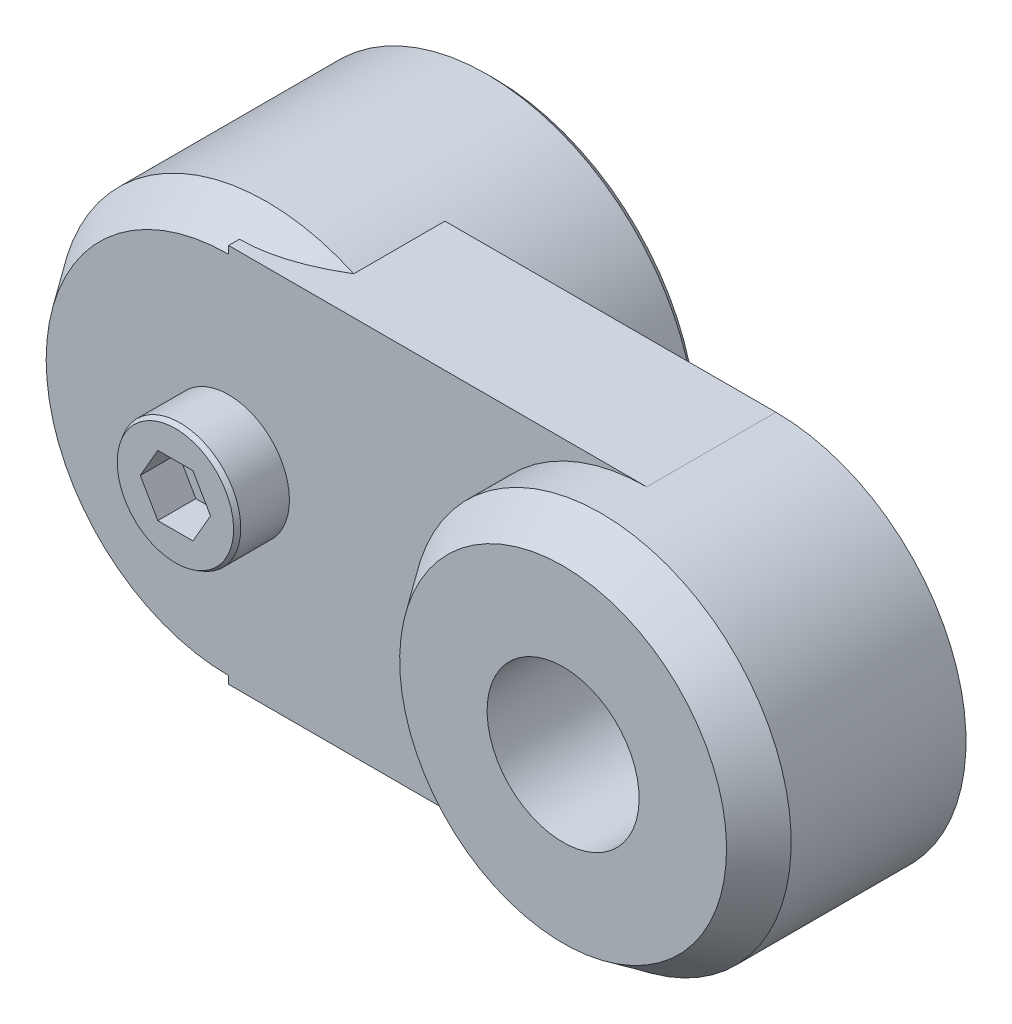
ISO-10303-21;
HEADER;
FILE_DESCRIPTION(('STEP AP214'),'2;1');
FILE_NAME('part.step','',(''),(''),'','','');
FILE_SCHEMA(('AUTOMOTIVE_DESIGN { 1 0 10303 214 1 1 1 1 }'));
ENDSEC;
DATA;
#1=APPLICATION_CONTEXT('core data for automotive mechanical design processes');
#2=APPLICATION_PROTOCOL_DEFINITION('international standard','automotive_design',2000,#1);
#3=PRODUCT_CONTEXT('',#1,'mechanical');
#4=PRODUCT('Part','Part','',(#3));
#5=PRODUCT_RELATED_PRODUCT_CATEGORY('part','',(#4));
#6=PRODUCT_DEFINITION_FORMATION('','',#4);
#7=PRODUCT_DEFINITION_CONTEXT('part definition',#1,'design');
#8=PRODUCT_DEFINITION('design','',#6,#7);
#9=PRODUCT_DEFINITION_SHAPE('','',#8);
#10=(LENGTH_UNIT() NAMED_UNIT(*) SI_UNIT(.MILLI.,.METRE.));
#11=(NAMED_UNIT(*) PLANE_ANGLE_UNIT() SI_UNIT($,.RADIAN.));
#12=(NAMED_UNIT(*) SI_UNIT($,.STERADIAN.) SOLID_ANGLE_UNIT());
#13=UNCERTAINTY_MEASURE_WITH_UNIT(LENGTH_MEASURE(1.E-05),#10,'distance_accuracy_value','');
#14=(GEOMETRIC_REPRESENTATION_CONTEXT(3) GLOBAL_UNCERTAINTY_ASSIGNED_CONTEXT((#13)) GLOBAL_UNIT_ASSIGNED_CONTEXT((#10,
#11,#12)) REPRESENTATION_CONTEXT('',''));
#15=CARTESIAN_POINT('',(0.,0.,0.));
#16=DIRECTION('',(0.,0.,1.));
#17=DIRECTION('',(1.,0.,0.));
#18=AXIS2_PLACEMENT_3D('',#15,#16,#17);
#19=CARTESIAN_POINT('',(0.,0.,35.));
#20=DIRECTION('',(0.,0.,1.));
#21=DIRECTION('',(0.,1.,0.));
#22=AXIS2_PLACEMENT_3D('',#19,#20,#21);
#23=PLANE('',#22);
#24=DIRECTION('',(-1.,0.,0.));
#25=VECTOR('',#24,1.);
#26=CARTESIAN_POINT('',(225.,-25.,35.));
#27=LINE('',#26,#25);
#28=CARTESIAN_POINT('',(55.,-25.,35.));
#29=VERTEX_POINT('',#28);
#30=CARTESIAN_POINT('',(0.,-25.,35.));
#31=VERTEX_POINT('',#30);
#32=EDGE_CURVE('E193',#29,#31,#27,.T.);
#33=ORIENTED_EDGE('',*,*,#32,.F.);
#34=CARTESIAN_POINT('',(55.,0.,35.));
#35=DIRECTION('',(0.,0.,1.));
#36=DIRECTION('',(0.,1.,0.));
#37=AXIS2_PLACEMENT_3D('',#34,#35,#36);
#38=CIRCLE('',#37,25.);
#39=CARTESIAN_POINT('',(55.,25.,35.));
#40=VERTEX_POINT('',#39);
#41=EDGE_CURVE('E173',#40,#29,#38,.T.);
#42=ORIENTED_EDGE('',*,*,#41,.F.);
#43=DIRECTION('',(-1.,0.,0.));
#44=VECTOR('',#43,1.);
#45=CARTESIAN_POINT('',(225.,25.,35.));
#46=LINE('',#45,#44);
#47=CARTESIAN_POINT('',(0.,25.,35.));
#48=VERTEX_POINT('',#47);
#49=EDGE_CURVE('E195',#40,#48,#46,.T.);
#50=ORIENTED_EDGE('',*,*,#49,.T.);
#51=DIRECTION('',(0.,1.,0.));
#52=VECTOR('',#51,1.);
#53=CARTESIAN_POINT('',(0.,-25.,35.));
#54=LINE('',#53,#52);
#55=CARTESIAN_POINT('',(0.,23.9989623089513,35.));
#56=VERTEX_POINT('',#55);
#57=EDGE_CURVE('E185',#56,#48,#54,.T.);
#58=ORIENTED_EDGE('',*,*,#57,.F.);
#59=CARTESIAN_POINT('',(0.,0.,35.));
#60=DIRECTION('',(0.,0.,1.));
#61=DIRECTION('',(0.,1.,0.));
#62=AXIS2_PLACEMENT_3D('',#59,#60,#61);
#63=CIRCLE('',#62,23.9989623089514);
#64=CARTESIAN_POINT('',(0.,-23.9989623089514,35.));
#65=VERTEX_POINT('',#64);
#66=EDGE_CURVE('E204',#56,#65,#63,.T.);
#67=ORIENTED_EDGE('',*,*,#66,.T.);
#68=EDGE_CURVE('E186',#31,#65,#54,.T.);
#69=ORIENTED_EDGE('',*,*,#68,.F.);
#70=EDGE_LOOP('',(#33,#42,#50,#58,#67,#69));
#71=FACE_BOUND('',#70,.T.);
#72=CARTESIAN_POINT('',(0.,0.,35.));
#73=DIRECTION('',(0.,0.,1.));
#74=DIRECTION('',(0.,1.,0.));
#75=AXIS2_PLACEMENT_3D('',#72,#73,#74);
#76=CIRCLE('',#75,8.);
#77=CARTESIAN_POINT('',(0.,8.,35.));
#78=VERTEX_POINT('',#77);
#79=EDGE_CURVE('E164',#78,#78,#76,.T.);
#80=ORIENTED_EDGE('',*,*,#79,.F.);
#81=EDGE_LOOP('',(#80));
#82=FACE_BOUND('',#81,.T.);
#83=ADVANCED_FACE('F14',(#71,#82),#23,.T.);
#84=CARTESIAN_POINT('',(225.,-25.,18.));
#85=DIRECTION('',(0.,0.,1.));
#86=DIRECTION('',(0.,1.,0.));
#87=AXIS2_PLACEMENT_3D('',#84,#85,#86);
#88=PLANE('',#87);
#89=CARTESIAN_POINT('',(55.,0.,18.));
#90=DIRECTION('',(0.,0.,1.));
#91=DIRECTION('',(0.,1.,0.));
#92=AXIS2_PLACEMENT_3D('',#89,#90,#91);
#93=CIRCLE('',#92,10.);
#94=CARTESIAN_POINT('',(55.,10.,18.));
#95=VERTEX_POINT('',#94);
#96=EDGE_CURVE('E170',#95,#95,#93,.T.);
#97=ORIENTED_EDGE('',*,*,#96,.T.);
#98=EDGE_LOOP('',(#97));
#99=FACE_BOUND('',#98,.T.);
#100=CARTESIAN_POINT('',(55.,0.,18.));
#101=DIRECTION('',(0.,0.,1.));
#102=DIRECTION('',(0.,1.,0.));
#103=AXIS2_PLACEMENT_3D('',#100,#101,#102);
#104=CIRCLE('',#103,25.);
#105=CARTESIAN_POINT('',(55.,-25.,18.));
#106=VERTEX_POINT('',#105);
#107=CARTESIAN_POINT('',(55.,25.,18.));
#108=VERTEX_POINT('',#107);
#109=EDGE_CURVE('E180',#106,#108,#104,.T.);
#110=ORIENTED_EDGE('',*,*,#109,.F.);
#111=DIRECTION('',(-1.,0.,0.));
#112=VECTOR('',#111,1.);
#113=CARTESIAN_POINT('',(225.,-25.,18.));
#114=LINE('',#113,#112);
#115=CARTESIAN_POINT('',(11.4564392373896,-25.,18.));
#116=VERTEX_POINT('',#115);
#117=EDGE_CURVE('E191',#106,#116,#114,.T.);
#118=ORIENTED_EDGE('',*,*,#117,.T.);
#119=CARTESIAN_POINT('',(0.,0.,18.));
#120=DIRECTION('',(0.,0.,1.));
#121=DIRECTION('',(0.,1.,0.));
#122=AXIS2_PLACEMENT_3D('',#119,#120,#121);
#123=CIRCLE('',#122,27.5);
#124=CARTESIAN_POINT('',(11.4564392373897,25.,18.));
#125=VERTEX_POINT('',#124);
#126=EDGE_CURVE('E242',#116,#125,#123,.T.);
#127=ORIENTED_EDGE('',*,*,#126,.T.);
#128=DIRECTION('',(-1.,0.,0.));
#129=VECTOR('',#128,1.);
#130=CARTESIAN_POINT('',(225.,25.,18.));
#131=LINE('',#130,#129);
#132=EDGE_CURVE('E197',#108,#125,#131,.T.);
#133=ORIENTED_EDGE('',*,*,#132,.F.);
#134=EDGE_LOOP('',(#110,#118,#127,#133));
#135=FACE_BOUND('',#134,.T.);
#136=ADVANCED_FACE('F249',(#99,#135),#88,.F.);
#137=CARTESIAN_POINT('',(225.,25.,18.));
#138=DIRECTION('',(0.,-1.,0.));
#139=DIRECTION('',(0.,0.,1.));
#140=AXIS2_PLACEMENT_3D('',#137,#138,#139);
#141=PLANE('',#140);
#142=DIRECTION('',(0.,0.,1.));
#143=VECTOR('',#142,1.);
#144=CARTESIAN_POINT('',(55.,25.,-190.));
#145=LINE('',#144,#143);
#146=EDGE_CURVE('E177',#108,#40,#145,.T.);
#147=ORIENTED_EDGE('',*,*,#146,.F.);
#148=ORIENTED_EDGE('',*,*,#132,.T.);
#149=DIRECTION('',(0.,0.,-1.));
#150=VECTOR('',#149,1.);
#151=CARTESIAN_POINT('',(11.4564392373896,25.,35.));
#152=LINE('',#151,#150);
#153=CARTESIAN_POINT('',(11.4564392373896,25.,30.));
#154=VERTEX_POINT('',#153);
#155=EDGE_CURVE('E202',#125,#154,#152,.F.);
#156=ORIENTED_EDGE('',*,*,#155,.T.);
#157=CARTESIAN_POINT('',(23.5156337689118,25.,20.2574791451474));
#158=CARTESIAN_POINT('',(23.2610089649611,25.,20.5066251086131));
#159=CARTESIAN_POINT('',(23.0053157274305,25.,20.7546780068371));
#160=CARTESIAN_POINT('',(22.4916376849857,25.,21.2484095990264));
#161=CARTESIAN_POINT('',(22.2336528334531,25.,21.494088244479));
#162=CARTESIAN_POINT('',(21.4559147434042,25.,22.22738778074));
#163=CARTESIAN_POINT('',(20.9325052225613,25.,22.7111474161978));
#164=CARTESIAN_POINT('',(19.8703592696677,25.,23.6702717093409));
#165=CARTESIAN_POINT('',(19.3315334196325,25.,24.1455375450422));
#166=CARTESIAN_POINT('',(18.2410725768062,25.,25.0810986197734));
#167=CARTESIAN_POINT('',(17.6894385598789,25.,25.5413949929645));
#168=CARTESIAN_POINT('',(16.536069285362,25.,26.4724714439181));
#169=CARTESIAN_POINT('',(15.9333741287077,25.,26.9420679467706));
#170=CARTESIAN_POINT('',(14.7087965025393,25.,27.855905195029));
#171=CARTESIAN_POINT('',(14.0869108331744,25.,28.3001416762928));
#172=CARTESIAN_POINT('',(12.8233471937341,25.,29.1553203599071));
#173=CARTESIAN_POINT('',(12.1817372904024,25.,29.5663624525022));
#174=CARTESIAN_POINT('',(10.8745497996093,25.,30.3480942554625));
#175=CARTESIAN_POINT('',(10.2089835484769,25.,30.7188027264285));
#176=CARTESIAN_POINT('',(8.87691400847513,25.,31.3964503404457));
#177=CARTESIAN_POINT('',(8.21136361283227,25.,31.7052465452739));
#178=CARTESIAN_POINT('',(6.85530500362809,25.,32.2639642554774));
#179=CARTESIAN_POINT('',(6.16479209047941,25.,32.5138746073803));
#180=CARTESIAN_POINT('',(5.12030630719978,25.,32.8323618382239));
#181=CARTESIAN_POINT('',(4.77458189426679,25.,32.9283607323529));
#182=CARTESIAN_POINT('',(4.07850406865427,25.,33.101676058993));
#183=CARTESIAN_POINT('',(3.72815154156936,25.,33.178996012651));
#184=CARTESIAN_POINT('',(3.02379681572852,25.,33.3136098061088));
#185=CARTESIAN_POINT('',(2.66979659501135,25.,33.3709139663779));
#186=CARTESIAN_POINT('',(1.95902577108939,25.,33.464483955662));
#187=CARTESIAN_POINT('',(1.60225535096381,25.,33.5007511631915));
#188=CARTESIAN_POINT('',(0.940908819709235,25.,33.5477212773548));
#189=CARTESIAN_POINT('',(0.636544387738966,25.,33.5614464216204));
#190=CARTESIAN_POINT('',(0.0274690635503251,25.,33.5729969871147));
#191=CARTESIAN_POINT('',(-0.277241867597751,25.,33.5708203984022));
#192=CARTESIAN_POINT('',(-0.886299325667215,25.,33.5505875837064));
#193=CARTESIAN_POINT('',(-1.19064556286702,25.,33.5325226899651));
#194=CARTESIAN_POINT('',(-1.7979599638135,25.,33.480772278));
#195=CARTESIAN_POINT('',(-2.10092830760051,25.,33.4470888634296));
#196=CARTESIAN_POINT('',(-2.71519481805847,25.,33.3631579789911));
#197=CARTESIAN_POINT('',(-3.02642028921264,25.,33.3123797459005));
#198=CARTESIAN_POINT('',(-3.64596973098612,25.,33.1953433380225));
#199=CARTESIAN_POINT('',(-3.95429339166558,25.,33.1290835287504));
#200=CARTESIAN_POINT('',(-4.56711836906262,25.,32.9820375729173));
#201=CARTESIAN_POINT('',(-4.87162314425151,25.,32.9012657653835));
#202=CARTESIAN_POINT('',(-5.47661118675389,25.,32.7261638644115));
#203=CARTESIAN_POINT('',(-5.77709569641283,25.,32.6318380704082));
#204=CARTESIAN_POINT('',(-6.07541297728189,25.,32.5312150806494));
#205=B_SPLINE_CURVE_WITH_KNOTS('',3,(#157,#158,#159,#160,#161,#162,#163,#164,#165,#166,#167,
#168,#169,#170,#171,#172,#173,#174,#175,#176,#177,#178,#179,#180,#181,#182,#183,#184,#185,#186,
#187,#188,#189,#190,#191,#192,#193,#194,#195,#196,#197,#198,#199,#200,#201,#202,#203,#204),
.UNSPECIFIED.,.F.,.F.,(4,2,2,2,2,2,2,2,2,2,2,2,2,2,2,2,2,2,2,2,2,2,2,4),(0.,1.06871624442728,
2.13745427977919,4.27546508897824,6.43067282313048,8.58571688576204,10.8773030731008,
13.1692734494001,15.4540676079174,17.7377944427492,19.9367026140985,22.1360269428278,
23.2120150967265,24.2878002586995,25.3630299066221,26.4381890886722,27.3518103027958,
28.2655469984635,29.1797824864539,30.0938948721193,31.0395053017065,31.9852156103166,
32.9299965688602,33.8744784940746),.UNSPECIFIED.);
#206=CARTESIAN_POINT('',(0.,25.,33.5703700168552));
#207=VERTEX_POINT('',#206);
#208=EDGE_CURVE('E213',#207,#154,#205,.F.);
#209=ORIENTED_EDGE('',*,*,#208,.F.);
#210=DIRECTION('',(0.,0.,1.));
#211=VECTOR('',#210,1.);
#212=CARTESIAN_POINT('',(0.,25.,18.));
#213=LINE('',#212,#211);
#214=EDGE_CURVE('E182',#207,#48,#213,.T.);
#215=ORIENTED_EDGE('',*,*,#214,.T.);
#216=ORIENTED_EDGE('',*,*,#49,.F.);
#217=EDGE_LOOP('',(#147,#148,#156,#209,#215,#216));
#218=FACE_BOUND('',#217,.T.);
#219=ADVANCED_FACE('F224',(#218),#141,.F.);
#220=CARTESIAN_POINT('',(225.,-25.,18.));
#221=DIRECTION('',(0.,-1.,0.));
#222=DIRECTION('',(0.,0.,1.));
#223=AXIS2_PLACEMENT_3D('',#220,#221,#222);
#224=PLANE('',#223);
#225=ORIENTED_EDGE('',*,*,#117,.F.);
#226=DIRECTION('',(0.,0.,1.));
#227=VECTOR('',#226,1.);
#228=CARTESIAN_POINT('',(55.,-25.,-190.));
#229=LINE('',#228,#227);
#230=EDGE_CURVE('E37',#106,#29,#229,.T.);
#231=ORIENTED_EDGE('',*,*,#230,.T.);
#232=ORIENTED_EDGE('',*,*,#32,.T.);
#233=DIRECTION('',(0.,0.,1.));
#234=VECTOR('',#233,1.);
#235=CARTESIAN_POINT('',(0.,-25.,18.));
#236=LINE('',#235,#234);
#237=CARTESIAN_POINT('',(0.,-25.,33.5703700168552));
#238=VERTEX_POINT('',#237);
#239=EDGE_CURVE('E188',#238,#31,#236,.T.);
#240=ORIENTED_EDGE('',*,*,#239,.F.);
#241=CARTESIAN_POINT('',(23.5156337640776,-25.,20.2574791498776));
#242=CARTESIAN_POINT('',(23.261008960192,-25.,20.5066251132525));
#243=CARTESIAN_POINT('',(23.0053157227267,-25.,20.7546780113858));
#244=CARTESIAN_POINT('',(22.4916376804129,-25.,21.2484096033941));
#245=CARTESIAN_POINT('',(22.2336528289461,-25.,21.4940882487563));
#246=CARTESIAN_POINT('',(21.4559147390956,-25.,22.2273877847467));
#247=CARTESIAN_POINT('',(20.9325052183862,-25.,22.7111474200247));
#248=CARTESIAN_POINT('',(19.8703592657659,-25.,23.6702717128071));
#249=CARTESIAN_POINT('',(19.3315334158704,-25.,24.1455375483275));
#250=CARTESIAN_POINT('',(18.2410725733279,-25.,25.0810986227));
#251=CARTESIAN_POINT('',(17.6894385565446,-25.,25.5413949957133));
#252=CARTESIAN_POINT('',(16.5360692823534,-25.,26.4724714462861));
#253=CARTESIAN_POINT('',(15.9333741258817,-25.,26.9420679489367));
#254=CARTESIAN_POINT('',(14.7087965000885,-25.,27.8559051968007));
#255=CARTESIAN_POINT('',(14.086910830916,-25.,28.3001416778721));
#256=CARTESIAN_POINT('',(12.8233471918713,-25.,29.1553203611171));
#257=CARTESIAN_POINT('',(12.1817372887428,-25.,29.5663624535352));
#258=CARTESIAN_POINT('',(10.8745497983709,-25.,30.3480942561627));
#259=CARTESIAN_POINT('',(10.2089835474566,-25.,30.7188027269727));
#260=CARTESIAN_POINT('',(8.8769140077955,-25.,31.3964503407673));
#261=CARTESIAN_POINT('',(8.21136361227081,-25.,31.7052465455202));
#262=CARTESIAN_POINT('',(6.85530500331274,-25.,32.2639642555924));
#263=CARTESIAN_POINT('',(6.16479209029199,-25.,32.5138746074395));
#264=CARTESIAN_POINT('',(5.12030630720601,-25.,32.832361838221));
#265=CARTESIAN_POINT('',(4.77458189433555,-25.,32.9283607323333));
#266=CARTESIAN_POINT('',(4.07850406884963,-25.,33.1016760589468));
#267=CARTESIAN_POINT('',(3.72815154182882,-25.,33.1789960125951));
#268=CARTESIAN_POINT('',(3.02379681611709,-25.,33.3136098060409));
#269=CARTESIAN_POINT('',(2.66979659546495,-25.,33.3709139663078));
#270=CARTESIAN_POINT('',(1.95902577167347,-25.,33.4644839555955));
#271=CARTESIAN_POINT('',(1.60225535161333,-25.,33.5007511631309));
#272=CARTESIAN_POINT('',(0.940908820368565,-25.,33.5477212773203));
#273=CARTESIAN_POINT('',(0.636544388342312,-25.,33.5614464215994));
#274=CARTESIAN_POINT('',(0.0274690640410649,-25.,33.5729969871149));
#275=CARTESIAN_POINT('',(-0.277241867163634,-25.,33.5708203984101));
#276=CARTESIAN_POINT('',(-0.886299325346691,-25.,33.5505875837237));
#277=CARTESIAN_POINT('',(-1.19064556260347,-25.,33.532522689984));
#278=CARTESIAN_POINT('',(-1.79795996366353,-25.,33.4807722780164));
#279=CARTESIAN_POINT('',(-2.10092830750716,-25.,33.4470888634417));
#280=CARTESIAN_POINT('',(-2.71519481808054,-25.,33.3631579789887));
#281=CARTESIAN_POINT('',(-3.02642028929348,-25.,33.3123797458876));
#282=CARTESIAN_POINT('',(-3.6459697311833,-25.,33.1953433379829));
#283=CARTESIAN_POINT('',(-3.95429339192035,-25.,33.1290835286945));
#284=CARTESIAN_POINT('',(-4.56711836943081,-25.,32.9820375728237));
#285=CARTESIAN_POINT('',(-4.87162314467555,-25.,32.9012657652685));
#286=CARTESIAN_POINT('',(-5.47661118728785,-25.,32.7261638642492));
#287=CARTESIAN_POINT('',(-5.77709569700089,-25.,32.63183807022));
#288=CARTESIAN_POINT('',(-6.07541297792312,-25.,32.5312150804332));
#289=B_SPLINE_CURVE_WITH_KNOTS('',3,(#241,#242,#243,#244,#245,#246,#247,#248,#249,#250,#251,
#252,#253,#254,#255,#256,#257,#258,#259,#260,#261,#262,#263,#264,#265,#266,#267,#268,#269,#270,
#271,#272,#273,#274,#275,#276,#277,#278,#279,#280,#281,#282,#283,#284,#285,#286,#287,#288),
.UNSPECIFIED.,.F.,.F.,(4,2,2,2,2,2,2,2,2,2,2,2,2,2,2,2,2,2,2,2,2,2,2,4),(0.,1.06871624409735,
2.13745427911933,4.27546508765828,6.43067282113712,8.58571688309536,10.8773030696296,
13.1692734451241,15.4540676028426,17.7377944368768,19.9367026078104,22.1360269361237,
23.2120150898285,24.2878002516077,25.3630298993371,26.438189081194,27.351810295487,
28.2655469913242,29.1797824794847,30.09389486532,31.0395052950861,31.9852156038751,
32.9299965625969,33.8744784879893),.UNSPECIFIED.);
#290=CARTESIAN_POINT('',(11.4564392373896,-25.,30.));
#291=VERTEX_POINT('',#290);
#292=EDGE_CURVE('E236',#238,#291,#289,.F.);
#293=ORIENTED_EDGE('',*,*,#292,.T.);
#294=DIRECTION('',(0.,0.,-1.));
#295=VECTOR('',#294,1.);
#296=CARTESIAN_POINT('',(11.4564392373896,-25.,35.));
#297=LINE('',#296,#295);
#298=EDGE_CURVE('E199',#116,#291,#297,.F.);
#299=ORIENTED_EDGE('',*,*,#298,.F.);
#300=EDGE_LOOP('',(#225,#231,#232,#240,#293,#299));
#301=FACE_BOUND('',#300,.T.);
#302=ADVANCED_FACE('F244',(#301),#224,.T.);
#303=CARTESIAN_POINT('',(0.,0.,35.));
#304=DIRECTION('',(0.,0.,-1.));
#305=DIRECTION('',(0.,-1.,0.));
#306=AXIS2_PLACEMENT_3D('',#303,#304,#305);
#307=CYLINDRICAL_SURFACE('',#306,27.5);
#308=CARTESIAN_POINT('',(0.,0.,1.00000000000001));
#309=DIRECTION('',(0.,0.,1.));
#310=DIRECTION('',(0.,1.,0.));
#311=AXIS2_PLACEMENT_3D('',#308,#309,#310);
#312=CIRCLE('',#311,27.5);
#313=CARTESIAN_POINT('',(0.,27.5,1.00000000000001));
#314=VERTEX_POINT('',#313);
#315=EDGE_CURVE('E330',#314,#314,#312,.T.);
#316=ORIENTED_EDGE('',*,*,#315,.T.);
#317=EDGE_LOOP('',(#316));
#318=FACE_BOUND('',#317,.T.);
#319=ORIENTED_EDGE('',*,*,#155,.F.);
#320=ORIENTED_EDGE('',*,*,#126,.F.);
#321=ORIENTED_EDGE('',*,*,#298,.T.);
#322=CARTESIAN_POINT('',(0.,0.,30.));
#323=DIRECTION('',(0.,0.,1.));
#324=DIRECTION('',(0.,1.,0.));
#325=AXIS2_PLACEMENT_3D('',#322,#323,#324);
#326=CIRCLE('',#325,27.5);
#327=EDGE_CURVE('E207',#291,#154,#326,.F.);
#328=ORIENTED_EDGE('',*,*,#327,.T.);
#329=EDGE_LOOP('',(#319,#320,#321,#328));
#330=FACE_BOUND('',#329,.T.);
#331=ADVANCED_FACE('F248',(#318,#330),#307,.T.);
#332=CARTESIAN_POINT('',(0.,0.,0.));
#333=DIRECTION('',(0.,0.,1.));
#334=DIRECTION('',(0.,1.,0.));
#335=AXIS2_PLACEMENT_3D('',#332,#333,#334);
#336=PLANE('',#335);
#337=CARTESIAN_POINT('',(0.,0.,0.));
#338=DIRECTION('',(0.,0.,1.));
#339=DIRECTION('',(0.,1.,0.));
#340=AXIS2_PLACEMENT_3D('',#337,#338,#339);
#341=CIRCLE('',#340,26.5);
#342=CARTESIAN_POINT('',(0.,26.5,0.));
#343=VERTEX_POINT('',#342);
#344=EDGE_CURVE('E505',#343,#343,#341,.F.);
#345=ORIENTED_EDGE('',*,*,#344,.T.);
#346=EDGE_LOOP('',(#345));
#347=FACE_BOUND('',#346,.T.);
#348=ADVANCED_FACE('F232',(#347),#336,.F.);
#349=CARTESIAN_POINT('',(0.,0.,35.));
#350=DIRECTION('',(0.,0.,-1.));
#351=DIRECTION('',(0.,-1.,0.));
#352=AXIS2_PLACEMENT_3D('',#349,#350,#351);
#353=CONICAL_SURFACE('',#352,23.9989623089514,0.610865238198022);
#354=ORIENTED_EDGE('',*,*,#292,.F.);
#355=DIRECTION('',(0.,-0.573576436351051,-0.819152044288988));
#356=VECTOR('',#355,1.);
#357=CARTESIAN_POINT('',(0.,0.,69.2740701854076));
#358=LINE('',#357,#356);
#359=EDGE_CURVE('E222',#238,#65,#358,.F.);
#360=ORIENTED_EDGE('',*,*,#359,.T.);
#361=ORIENTED_EDGE('',*,*,#66,.F.);
#362=DIRECTION('',(0.,-0.573576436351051,0.819152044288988));
#363=VECTOR('',#362,1.);
#364=CARTESIAN_POINT('',(0.,0.,69.2740701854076));
#365=LINE('',#364,#363);
#366=EDGE_CURVE('E210',#56,#207,#365,.F.);
#367=ORIENTED_EDGE('',*,*,#366,.T.);
#368=ORIENTED_EDGE('',*,*,#208,.T.);
#369=ORIENTED_EDGE('',*,*,#327,.F.);
#370=EDGE_LOOP('',(#354,#360,#361,#367,#368,#369));
#371=FACE_BOUND('',#370,.T.);
#372=ADVANCED_FACE('F227',(#371),#353,.T.);
#373=CARTESIAN_POINT('',(0.,25.,18.));
#374=DIRECTION('',(1.,0.,0.));
#375=DIRECTION('',(0.,0.,-1.));
#376=AXIS2_PLACEMENT_3D('',#373,#374,#375);
#377=PLANE('',#376);
#378=ORIENTED_EDGE('',*,*,#359,.F.);
#379=ORIENTED_EDGE('',*,*,#239,.T.);
#380=ORIENTED_EDGE('',*,*,#68,.T.);
#381=EDGE_LOOP('',(#378,#379,#380));
#382=FACE_BOUND('',#381,.T.);
#383=ADVANCED_FACE('F231',(#382),#377,.F.);
#384=ORIENTED_EDGE('',*,*,#366,.F.);
#385=ORIENTED_EDGE('',*,*,#57,.T.);
#386=ORIENTED_EDGE('',*,*,#214,.F.);
#387=EDGE_LOOP('',(#384,#385,#386));
#388=FACE_BOUND('',#387,.T.);
#389=ADVANCED_FACE('F253',(#388),#377,.F.);
#390=CARTESIAN_POINT('',(55.,0.,-190.));
#391=DIRECTION('',(0.,0.,1.));
#392=DIRECTION('',(0.,1.,0.));
#393=AXIS2_PLACEMENT_3D('',#390,#391,#392);
#394=CYLINDRICAL_SURFACE('',#393,25.);
#395=CARTESIAN_POINT('',(55.,0.,41.));
#396=DIRECTION('',(0.,0.,1.));
#397=DIRECTION('',(0.,1.,0.));
#398=AXIS2_PLACEMENT_3D('',#395,#396,#397);
#399=CIRCLE('',#398,25.);
#400=CARTESIAN_POINT('',(55.,25.,41.));
#401=VERTEX_POINT('',#400);
#402=EDGE_CURVE('E498',#401,#401,#399,.F.);
#403=ORIENTED_EDGE('',*,*,#402,.T.);
#404=EDGE_LOOP('',(#403));
#405=FACE_BOUND('',#404,.T.);
#406=ORIENTED_EDGE('',*,*,#109,.T.);
#407=ORIENTED_EDGE('',*,*,#146,.T.);
#408=ORIENTED_EDGE('',*,*,#41,.T.);
#409=ORIENTED_EDGE('',*,*,#230,.F.);
#410=EDGE_LOOP('',(#406,#407,#408,#409));
#411=FACE_BOUND('',#410,.T.);
#412=ADVANCED_FACE('F256',(#405,#411),#394,.T.);
#413=CARTESIAN_POINT('',(55.,0.,46.));
#414=DIRECTION('',(0.,0.,1.));
#415=DIRECTION('',(0.,1.,0.));
#416=AXIS2_PLACEMENT_3D('',#413,#414,#415);
#417=PLANE('',#416);
#418=CARTESIAN_POINT('',(55.,0.,46.));
#419=DIRECTION('',(0.,0.,1.));
#420=DIRECTION('',(0.,1.,0.));
#421=AXIS2_PLACEMENT_3D('',#418,#419,#420);
#422=CIRCLE('',#421,10.);
#423=CARTESIAN_POINT('',(55.,10.,46.));
#424=VERTEX_POINT('',#423);
#425=EDGE_CURVE('E167',#424,#424,#422,.T.);
#426=ORIENTED_EDGE('',*,*,#425,.F.);
#427=EDGE_LOOP('',(#426));
#428=FACE_BOUND('',#427,.T.);
#429=CARTESIAN_POINT('',(55.,0.,46.));
#430=DIRECTION('',(0.,0.,1.));
#431=DIRECTION('',(0.,1.,0.));
#432=AXIS2_PLACEMENT_3D('',#429,#430,#431);
#433=CIRCLE('',#432,21.4989623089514);
#434=CARTESIAN_POINT('',(55.,21.4989623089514,46.));
#435=VERTEX_POINT('',#434);
#436=EDGE_CURVE('E496',#435,#435,#433,.T.);
#437=ORIENTED_EDGE('',*,*,#436,.T.);
#438=EDGE_LOOP('',(#437));
#439=FACE_BOUND('',#438,.T.);
#440=ADVANCED_FACE('F260',(#428,#439),#417,.T.);
#441=CARTESIAN_POINT('',(55.,0.,46.));
#442=DIRECTION('',(0.,0.,-1.));
#443=DIRECTION('',(0.,-1.,0.));
#444=AXIS2_PLACEMENT_3D('',#441,#442,#443);
#445=CONICAL_SURFACE('',#444,21.4989623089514,0.610865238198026);
#446=ORIENTED_EDGE('',*,*,#402,.F.);
#447=EDGE_LOOP('',(#446));
#448=FACE_BOUND('',#447,.T.);
#449=ORIENTED_EDGE('',*,*,#436,.F.);
#450=EDGE_LOOP('',(#449));
#451=FACE_BOUND('',#450,.T.);
#452=ADVANCED_FACE('F264',(#448,#451),#445,.T.);
#453=CARTESIAN_POINT('',(55.,0.,0.));
#454=DIRECTION('',(0.,0.,1.));
#455=DIRECTION('',(0.,1.,0.));
#456=AXIS2_PLACEMENT_3D('',#453,#454,#455);
#457=CYLINDRICAL_SURFACE('',#456,10.);
#458=ORIENTED_EDGE('',*,*,#425,.T.);
#459=EDGE_LOOP('',(#458));
#460=FACE_BOUND('',#459,.T.);
#461=ORIENTED_EDGE('',*,*,#96,.F.);
#462=EDGE_LOOP('',(#461));
#463=FACE_BOUND('',#462,.T.);
#464=ADVANCED_FACE('F268',(#460,#463),#457,.F.);
#465=CARTESIAN_POINT('',(0.,0.,42.));
#466=DIRECTION('',(0.,0.,-1.));
#467=DIRECTION('',(0.,-1.,0.));
#468=AXIS2_PLACEMENT_3D('',#465,#466,#467);
#469=CYLINDRICAL_SURFACE('',#468,8.);
#470=CARTESIAN_POINT('',(0.,0.,41.4));
#471=DIRECTION('',(0.,0.,1.));
#472=DIRECTION('',(0.,-1.,0.));
#473=AXIS2_PLACEMENT_3D('',#470,#471,#472);
#474=CIRCLE('',#473,8.);
#475=CARTESIAN_POINT('',(0.,-8.,41.4));
#476=VERTEX_POINT('',#475);
#477=EDGE_CURVE('E9',#476,#476,#474,.F.);
#478=ORIENTED_EDGE('',*,*,#477,.T.);
#479=EDGE_LOOP('',(#478));
#480=FACE_BOUND('',#479,.T.);
#481=ORIENTED_EDGE('',*,*,#79,.T.);
#482=EDGE_LOOP('',(#481));
#483=FACE_BOUND('',#482,.T.);
#484=ADVANCED_FACE('F272',(#480,#483),#469,.T.);
#485=CARTESIAN_POINT('',(0.,0.,42.));
#486=DIRECTION('',(0.,0.,1.));
#487=DIRECTION('',(0.,1.,0.));
#488=AXIS2_PLACEMENT_3D('',#485,#486,#487);
#489=PLANE('',#488);
#490=CARTESIAN_POINT('',(0.,0.,42.));
#491=DIRECTION('',(0.,0.,1.));
#492=DIRECTION('',(0.,-1.,0.));
#493=AXIS2_PLACEMENT_3D('',#490,#491,#492);
#494=CIRCLE('',#493,7.6535898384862);
#495=CARTESIAN_POINT('',(0.,-7.6535898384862,42.));
#496=VERTEX_POINT('',#495);
#497=EDGE_CURVE('E22',#496,#496,#494,.T.);
#498=ORIENTED_EDGE('',*,*,#497,.T.);
#499=EDGE_LOOP('',(#498));
#500=FACE_BOUND('',#499,.T.);
#501=DIRECTION('',(-0.5,-0.866025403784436,0.));
#502=VECTOR('',#501,1.);
#503=CARTESIAN_POINT('',(-2.30940107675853,4.,42.));
#504=LINE('',#503,#502);
#505=CARTESIAN_POINT('',(-2.30940107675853,4.,42.));
#506=VERTEX_POINT('',#505);
#507=CARTESIAN_POINT('',(-4.61880215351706,0.,42.));
#508=VERTEX_POINT('',#507);
#509=EDGE_CURVE('E29',#506,#508,#504,.T.);
#510=ORIENTED_EDGE('',*,*,#509,.F.);
#511=DIRECTION('',(1.,0.,0.));
#512=VECTOR('',#511,1.);
#513=CARTESIAN_POINT('',(-2.30940107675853,4.,42.));
#514=LINE('',#513,#512);
#515=CARTESIAN_POINT('',(2.30940107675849,4.,42.));
#516=VERTEX_POINT('',#515);
#517=EDGE_CURVE('E138',#506,#516,#514,.T.);
#518=ORIENTED_EDGE('',*,*,#517,.T.);
#519=DIRECTION('',(0.5,-0.86602540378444,0.));
#520=VECTOR('',#519,1.);
#521=CARTESIAN_POINT('',(2.30940107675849,4.,42.));
#522=LINE('',#521,#520);
#523=CARTESIAN_POINT('',(4.61880215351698,0.,42.));
#524=VERTEX_POINT('',#523);
#525=EDGE_CURVE('E133',#516,#524,#522,.T.);
#526=ORIENTED_EDGE('',*,*,#525,.T.);
#527=DIRECTION('',(0.5,0.86602540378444,0.));
#528=VECTOR('',#527,1.);
#529=CARTESIAN_POINT('',(2.30940107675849,-4.,42.));
#530=LINE('',#529,#528);
#531=CARTESIAN_POINT('',(2.30940107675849,-4.,42.));
#532=VERTEX_POINT('',#531);
#533=EDGE_CURVE('E131',#532,#524,#530,.T.);
#534=ORIENTED_EDGE('',*,*,#533,.F.);
#535=DIRECTION('',(1.,0.,0.));
#536=VECTOR('',#535,1.);
#537=CARTESIAN_POINT('',(-2.30940107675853,-4.,42.));
#538=LINE('',#537,#536);
#539=CARTESIAN_POINT('',(-2.30940107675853,-4.,42.));
#540=VERTEX_POINT('',#539);
#541=EDGE_CURVE('E113',#540,#532,#538,.T.);
#542=ORIENTED_EDGE('',*,*,#541,.F.);
#543=DIRECTION('',(-0.5,0.866025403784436,0.));
#544=VECTOR('',#543,1.);
#545=CARTESIAN_POINT('',(-2.30940107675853,-4.,42.));
#546=LINE('',#545,#544);
#547=EDGE_CURVE('E124',#540,#508,#546,.T.);
#548=ORIENTED_EDGE('',*,*,#547,.T.);
#549=EDGE_LOOP('',(#510,#518,#526,#534,#542,#548));
#550=FACE_BOUND('',#549,.T.);
#551=ADVANCED_FACE('F128',(#500,#550),#489,.T.);
#552=CARTESIAN_POINT('',(-2.30940107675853,4.,37.));
#553=DIRECTION('',(-0.866025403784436,0.5,0.));
#554=DIRECTION('',(-0.5,-0.866025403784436,0.));
#555=AXIS2_PLACEMENT_3D('',#552,#553,#554);
#556=PLANE('',#555);
#557=DIRECTION('',(0.,0.,1.));
#558=VECTOR('',#557,1.);
#559=CARTESIAN_POINT('',(-2.30940107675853,4.,37.));
#560=LINE('',#559,#558);
#561=CARTESIAN_POINT('',(-2.30940107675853,4.,37.));
#562=VERTEX_POINT('',#561);
#563=EDGE_CURVE('E162',#562,#506,#560,.T.);
#564=ORIENTED_EDGE('',*,*,#563,.T.);
#565=ORIENTED_EDGE('',*,*,#509,.T.);
#566=DIRECTION('',(0.,0.,1.));
#567=VECTOR('',#566,1.);
#568=CARTESIAN_POINT('',(-4.61880215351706,0.,37.));
#569=LINE('',#568,#567);
#570=CARTESIAN_POINT('',(-4.61880215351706,0.,37.));
#571=VERTEX_POINT('',#570);
#572=EDGE_CURVE('E121',#571,#508,#569,.T.);
#573=ORIENTED_EDGE('',*,*,#572,.F.);
#574=DIRECTION('',(-0.5,-0.866025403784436,0.));
#575=VECTOR('',#574,1.);
#576=CARTESIAN_POINT('',(-2.30940107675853,4.,37.));
#577=LINE('',#576,#575);
#578=EDGE_CURVE('E141',#562,#571,#577,.T.);
#579=ORIENTED_EDGE('',*,*,#578,.F.);
#580=EDGE_LOOP('',(#564,#565,#573,#579));
#581=FACE_BOUND('',#580,.T.);
#582=ADVANCED_FACE('F277',(#581),#556,.F.);
#583=CARTESIAN_POINT('',(-2.30940107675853,4.,37.));
#584=DIRECTION('',(0.,-1.,0.));
#585=DIRECTION('',(1.,0.,0.));
#586=AXIS2_PLACEMENT_3D('',#583,#584,#585);
#587=PLANE('',#586);
#588=DIRECTION('',(0.,0.,1.));
#589=VECTOR('',#588,1.);
#590=CARTESIAN_POINT('',(2.30940107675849,4.,37.));
#591=LINE('',#590,#589);
#592=CARTESIAN_POINT('',(2.30940107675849,4.,37.));
#593=VERTEX_POINT('',#592);
#594=EDGE_CURVE('E160',#593,#516,#591,.T.);
#595=ORIENTED_EDGE('',*,*,#594,.T.);
#596=ORIENTED_EDGE('',*,*,#517,.F.);
#597=ORIENTED_EDGE('',*,*,#563,.F.);
#598=DIRECTION('',(1.,0.,0.));
#599=VECTOR('',#598,1.);
#600=CARTESIAN_POINT('',(-2.30940107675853,4.,37.));
#601=LINE('',#600,#599);
#602=EDGE_CURVE('E153',#562,#593,#601,.T.);
#603=ORIENTED_EDGE('',*,*,#602,.T.);
#604=EDGE_LOOP('',(#595,#596,#597,#603));
#605=FACE_BOUND('',#604,.T.);
#606=ADVANCED_FACE('F281',(#605),#587,.T.);
#607=CARTESIAN_POINT('',(2.30940107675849,4.,37.));
#608=DIRECTION('',(-0.86602540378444,-0.5,0.));
#609=DIRECTION('',(0.5,-0.86602540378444,0.));
#610=AXIS2_PLACEMENT_3D('',#607,#608,#609);
#611=PLANE('',#610);
#612=DIRECTION('',(0.,0.,1.));
#613=VECTOR('',#612,1.);
#614=CARTESIAN_POINT('',(4.61880215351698,0.,37.));
#615=LINE('',#614,#613);
#616=CARTESIAN_POINT('',(4.61880215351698,0.,37.));
#617=VERTEX_POINT('',#616);
#618=EDGE_CURVE('E158',#617,#524,#615,.T.);
#619=ORIENTED_EDGE('',*,*,#618,.T.);
#620=ORIENTED_EDGE('',*,*,#525,.F.);
#621=ORIENTED_EDGE('',*,*,#594,.F.);
#622=DIRECTION('',(0.5,-0.86602540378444,0.));
#623=VECTOR('',#622,1.);
#624=CARTESIAN_POINT('',(2.30940107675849,4.,37.));
#625=LINE('',#624,#623);
#626=EDGE_CURVE('E150',#593,#617,#625,.T.);
#627=ORIENTED_EDGE('',*,*,#626,.T.);
#628=EDGE_LOOP('',(#619,#620,#621,#627));
#629=FACE_BOUND('',#628,.T.);
#630=ADVANCED_FACE('F284',(#629),#611,.T.);
#631=CARTESIAN_POINT('',(2.30940107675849,-4.,37.));
#632=DIRECTION('',(0.86602540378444,-0.5,0.));
#633=DIRECTION('',(0.5,0.86602540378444,0.));
#634=AXIS2_PLACEMENT_3D('',#631,#632,#633);
#635=PLANE('',#634);
#636=DIRECTION('',(0.,0.,1.));
#637=VECTOR('',#636,1.);
#638=CARTESIAN_POINT('',(2.30940107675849,-4.,37.));
#639=LINE('',#638,#637);
#640=CARTESIAN_POINT('',(2.30940107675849,-4.,37.));
#641=VERTEX_POINT('',#640);
#642=EDGE_CURVE('E120',#641,#532,#639,.T.);
#643=ORIENTED_EDGE('',*,*,#642,.T.);
#644=ORIENTED_EDGE('',*,*,#533,.T.);
#645=ORIENTED_EDGE('',*,*,#618,.F.);
#646=DIRECTION('',(0.5,0.86602540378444,0.));
#647=VECTOR('',#646,1.);
#648=CARTESIAN_POINT('',(2.30940107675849,-4.,37.));
#649=LINE('',#648,#647);
#650=EDGE_CURVE('E147',#641,#617,#649,.T.);
#651=ORIENTED_EDGE('',*,*,#650,.F.);
#652=EDGE_LOOP('',(#643,#644,#645,#651));
#653=FACE_BOUND('',#652,.T.);
#654=ADVANCED_FACE('F288',(#653),#635,.F.);
#655=CARTESIAN_POINT('',(-2.30940107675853,-4.,37.));
#656=DIRECTION('',(0.,-1.,0.));
#657=DIRECTION('',(1.,0.,0.));
#658=AXIS2_PLACEMENT_3D('',#655,#656,#657);
#659=PLANE('',#658);
#660=DIRECTION('',(0.,0.,1.));
#661=VECTOR('',#660,1.);
#662=CARTESIAN_POINT('',(-2.30940107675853,-4.,37.));
#663=LINE('',#662,#661);
#664=CARTESIAN_POINT('',(-2.30940107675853,-4.,37.));
#665=VERTEX_POINT('',#664);
#666=EDGE_CURVE('E109',#665,#540,#663,.T.);
#667=ORIENTED_EDGE('',*,*,#666,.T.);
#668=ORIENTED_EDGE('',*,*,#541,.T.);
#669=ORIENTED_EDGE('',*,*,#642,.F.);
#670=DIRECTION('',(1.,0.,0.));
#671=VECTOR('',#670,1.);
#672=CARTESIAN_POINT('',(-2.30940107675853,-4.,37.));
#673=LINE('',#672,#671);
#674=EDGE_CURVE('E116',#665,#641,#673,.T.);
#675=ORIENTED_EDGE('',*,*,#674,.F.);
#676=EDGE_LOOP('',(#667,#668,#669,#675));
#677=FACE_BOUND('',#676,.T.);
#678=ADVANCED_FACE('F111',(#677),#659,.F.);
#679=CARTESIAN_POINT('',(-2.30940107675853,-4.,37.));
#680=DIRECTION('',(0.866025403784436,0.5,0.));
#681=DIRECTION('',(-0.5,0.866025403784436,0.));
#682=AXIS2_PLACEMENT_3D('',#679,#680,#681);
#683=PLANE('',#682);
#684=DIRECTION('',(-0.5,0.866025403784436,0.));
#685=VECTOR('',#684,1.);
#686=CARTESIAN_POINT('',(-2.30940107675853,-4.,37.));
#687=LINE('',#686,#685);
#688=EDGE_CURVE('E144',#665,#571,#687,.T.);
#689=ORIENTED_EDGE('',*,*,#688,.T.);
#690=ORIENTED_EDGE('',*,*,#572,.T.);
#691=ORIENTED_EDGE('',*,*,#547,.F.);
#692=ORIENTED_EDGE('',*,*,#666,.F.);
#693=EDGE_LOOP('',(#689,#690,#691,#692));
#694=FACE_BOUND('',#693,.T.);
#695=ADVANCED_FACE('F125',(#694),#683,.T.);
#696=CARTESIAN_POINT('',(-4.61880215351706,0.,37.));
#697=DIRECTION('',(0.,0.,-1.));
#698=DIRECTION('',(0.,-1.,0.));
#699=AXIS2_PLACEMENT_3D('',#696,#697,#698);
#700=PLANE('',#699);
#701=ORIENTED_EDGE('',*,*,#578,.T.);
#702=ORIENTED_EDGE('',*,*,#688,.F.);
#703=ORIENTED_EDGE('',*,*,#674,.T.);
#704=ORIENTED_EDGE('',*,*,#650,.T.);
#705=ORIENTED_EDGE('',*,*,#626,.F.);
#706=ORIENTED_EDGE('',*,*,#602,.F.);
#707=EDGE_LOOP('',(#701,#702,#703,#704,#705,#706));
#708=FACE_BOUND('',#707,.T.);
#709=ADVANCED_FACE('F295',(#708),#700,.F.);
#710=CARTESIAN_POINT('',(0.,0.,1.00000000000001));
#711=DIRECTION('',(0.,0.,1.));
#712=DIRECTION('',(0.,1.,0.));
#713=AXIS2_PLACEMENT_3D('',#710,#711,#712);
#714=CONICAL_SURFACE('',#713,27.5,0.785398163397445);
#715=ORIENTED_EDGE('',*,*,#344,.F.);
#716=EDGE_LOOP('',(#715));
#717=FACE_BOUND('',#716,.T.);
#718=ORIENTED_EDGE('',*,*,#315,.F.);
#719=EDGE_LOOP('',(#718));
#720=FACE_BOUND('',#719,.T.);
#721=ADVANCED_FACE('F298',(#717,#720),#714,.T.);
#722=CARTESIAN_POINT('',(0.,0.,42.));
#723=DIRECTION('',(0.,0.,-1.));
#724=DIRECTION('',(0.,1.,0.));
#725=AXIS2_PLACEMENT_3D('',#722,#723,#724);
#726=CONICAL_SURFACE('',#725,7.6535898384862,0.523598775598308);
#727=ORIENTED_EDGE('',*,*,#477,.F.);
#728=EDGE_LOOP('',(#727));
#729=FACE_BOUND('',#728,.T.);
#730=ORIENTED_EDGE('',*,*,#497,.F.);
#731=EDGE_LOOP('',(#730));
#732=FACE_BOUND('',#731,.T.);
#733=ADVANCED_FACE('F16',(#729,#732),#726,.T.);
#734=CLOSED_SHELL('',(#83,#136,#219,#302,#331,#348,#372,#383,#389,#412,#440,#452,#464,#484,#551,
#582,#606,#630,#654,#678,#695,#709,#721,#733));
#735=MANIFOLD_SOLID_BREP('B1',#734);
#736=ADVANCED_BREP_SHAPE_REPRESENTATION('',(#18,#735),#14);
#737=SHAPE_DEFINITION_REPRESENTATION(#9,#736);
ENDSEC;
END-ISO-10303-21;
